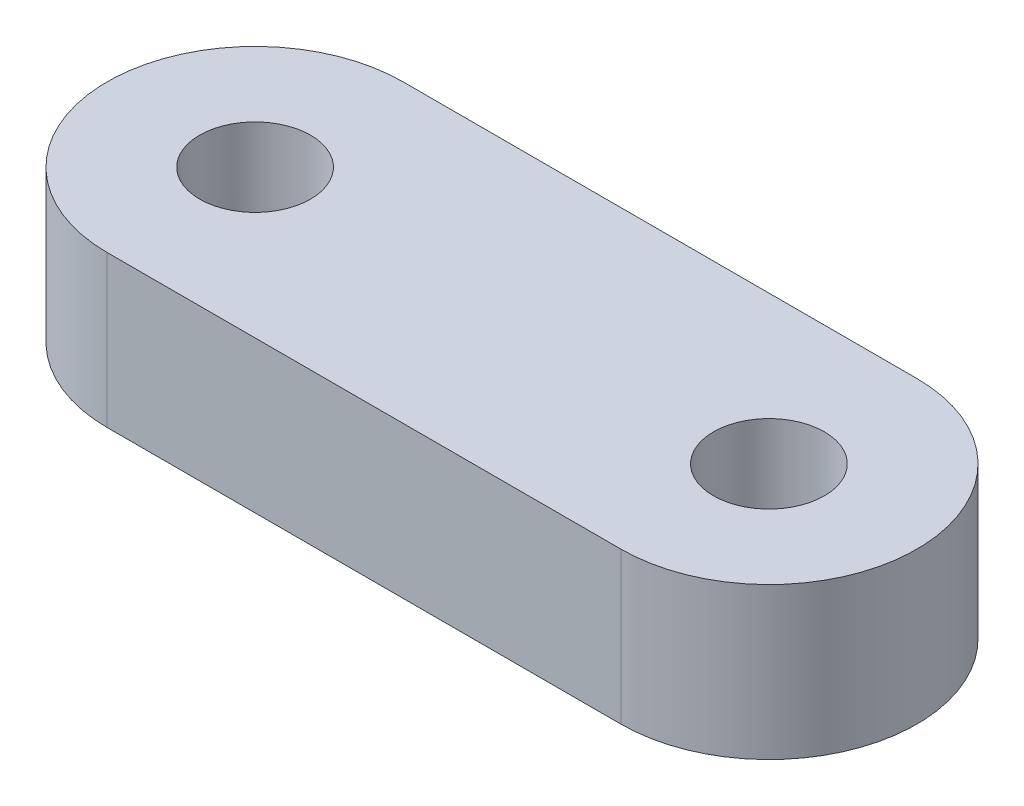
ISO-10303-21;
HEADER;
FILE_DESCRIPTION(('STEP AP214'),'2;1');
FILE_NAME('part.step','',(''),(''),'','','');
FILE_SCHEMA(('AUTOMOTIVE_DESIGN { 1 0 10303 214 1 1 1 1 }'));
ENDSEC;
DATA;
#1=APPLICATION_CONTEXT('core data for automotive mechanical design processes');
#2=APPLICATION_PROTOCOL_DEFINITION('international standard','automotive_design',2000,#1);
#3=PRODUCT_CONTEXT('',#1,'mechanical');
#4=PRODUCT('Part','Part','',(#3));
#5=PRODUCT_RELATED_PRODUCT_CATEGORY('part','',(#4));
#6=PRODUCT_DEFINITION_FORMATION('','',#4);
#7=PRODUCT_DEFINITION_CONTEXT('part definition',#1,'design');
#8=PRODUCT_DEFINITION('design','',#6,#7);
#9=PRODUCT_DEFINITION_SHAPE('','',#8);
#10=(LENGTH_UNIT() NAMED_UNIT(*) SI_UNIT(.MILLI.,.METRE.));
#11=(NAMED_UNIT(*) PLANE_ANGLE_UNIT() SI_UNIT($,.RADIAN.));
#12=(NAMED_UNIT(*) SI_UNIT($,.STERADIAN.) SOLID_ANGLE_UNIT());
#13=UNCERTAINTY_MEASURE_WITH_UNIT(LENGTH_MEASURE(1.E-05),#10,'distance_accuracy_value','');
#14=(GEOMETRIC_REPRESENTATION_CONTEXT(3) GLOBAL_UNCERTAINTY_ASSIGNED_CONTEXT((#13)) GLOBAL_UNIT_ASSIGNED_CONTEXT((#10,
#11,#12)) REPRESENTATION_CONTEXT('',''));
#15=CARTESIAN_POINT('',(0.,0.,0.));
#16=DIRECTION('',(0.,0.,1.));
#17=DIRECTION('',(1.,0.,0.));
#18=AXIS2_PLACEMENT_3D('',#15,#16,#17);
#19=CARTESIAN_POINT('',(13.9,0.05,-4.));
#20=DIRECTION('',(0.,0.,1.));
#21=DIRECTION('',(0.,-1.,0.));
#22=AXIS2_PLACEMENT_3D('',#19,#20,#21);
#23=PLANE('',#22);
#24=DIRECTION('',(0.,-1.,0.));
#25=VECTOR('',#24,1.);
#26=CARTESIAN_POINT('',(13.9,0.05,-4.));
#27=LINE('',#26,#25);
#28=CARTESIAN_POINT('',(13.9,2.05,-4.));
#29=VERTEX_POINT('',#28);
#30=CARTESIAN_POINT('',(13.9,-2.05,-4.));
#31=VERTEX_POINT('',#30);
#32=EDGE_CURVE('E31',#29,#31,#27,.T.);
#33=ORIENTED_EDGE('',*,*,#32,.T.);
#34=DIRECTION('',(1.,0.,0.));
#35=VECTOR('',#34,1.);
#36=CARTESIAN_POINT('',(0.,-2.05,-4.));
#37=LINE('',#36,#35);
#38=CARTESIAN_POINT('',(0.,-2.05,-4.));
#39=VERTEX_POINT('',#38);
#40=EDGE_CURVE('E68',#39,#31,#37,.T.);
#41=ORIENTED_EDGE('',*,*,#40,.F.);
#42=DIRECTION('',(0.,-1.,0.));
#43=VECTOR('',#42,1.);
#44=CARTESIAN_POINT('',(0.,0.05,-4.));
#45=LINE('',#44,#43);
#46=CARTESIAN_POINT('',(0.,2.05,-4.));
#47=VERTEX_POINT('',#46);
#48=EDGE_CURVE('E9',#47,#39,#45,.T.);
#49=ORIENTED_EDGE('',*,*,#48,.F.);
#50=DIRECTION('',(-1.,0.,0.));
#51=VECTOR('',#50,1.);
#52=CARTESIAN_POINT('',(13.9,2.05,-4.));
#53=LINE('',#52,#51);
#54=EDGE_CURVE('E86',#29,#47,#53,.T.);
#55=ORIENTED_EDGE('',*,*,#54,.F.);
#56=EDGE_LOOP('',(#33,#41,#49,#55));
#57=FACE_BOUND('',#56,.T.);
#58=ADVANCED_FACE('F14',(#57),#23,.F.);
#59=CARTESIAN_POINT('',(0.,0.05,0.));
#60=DIRECTION('',(0.,-1.,0.));
#61=DIRECTION('',(-1.,0.,0.));
#62=AXIS2_PLACEMENT_3D('',#59,#60,#61);
#63=CYLINDRICAL_SURFACE('',#62,4.);
#64=ORIENTED_EDGE('',*,*,#48,.T.);
#65=CARTESIAN_POINT('',(0.,-2.05,0.));
#66=DIRECTION('',(0.,-1.,0.));
#67=DIRECTION('',(-1.,0.,0.));
#68=AXIS2_PLACEMENT_3D('',#65,#66,#67);
#69=CIRCLE('',#68,4.);
#70=CARTESIAN_POINT('',(0.,-2.05,4.));
#71=VERTEX_POINT('',#70);
#72=EDGE_CURVE('E61',#71,#39,#69,.T.);
#73=ORIENTED_EDGE('',*,*,#72,.F.);
#74=DIRECTION('',(0.,-1.,0.));
#75=VECTOR('',#74,1.);
#76=CARTESIAN_POINT('',(0.,0.05,4.));
#77=LINE('',#76,#75);
#78=CARTESIAN_POINT('',(0.,2.05,4.));
#79=VERTEX_POINT('',#78);
#80=EDGE_CURVE('E23',#79,#71,#77,.T.);
#81=ORIENTED_EDGE('',*,*,#80,.F.);
#82=CARTESIAN_POINT('',(0.,2.05,0.));
#83=DIRECTION('',(0.,1.,0.));
#84=DIRECTION('',(1.,0.,0.));
#85=AXIS2_PLACEMENT_3D('',#82,#83,#84);
#86=CIRCLE('',#85,4.);
#87=EDGE_CURVE('E63',#47,#79,#86,.T.);
#88=ORIENTED_EDGE('',*,*,#87,.F.);
#89=EDGE_LOOP('',(#64,#73,#81,#88));
#90=FACE_BOUND('',#89,.T.);
#91=ADVANCED_FACE('F59',(#90),#63,.T.);
#92=CARTESIAN_POINT('',(0.,0.05,4.));
#93=DIRECTION('',(0.,0.,-1.));
#94=DIRECTION('',(0.,1.,0.));
#95=AXIS2_PLACEMENT_3D('',#92,#93,#94);
#96=PLANE('',#95);
#97=ORIENTED_EDGE('',*,*,#80,.T.);
#98=DIRECTION('',(-1.,0.,0.));
#99=VECTOR('',#98,1.);
#100=CARTESIAN_POINT('',(13.9,-2.05,4.));
#101=LINE('',#100,#99);
#102=CARTESIAN_POINT('',(13.9,-2.05,4.));
#103=VERTEX_POINT('',#102);
#104=EDGE_CURVE('E76',#103,#71,#101,.T.);
#105=ORIENTED_EDGE('',*,*,#104,.F.);
#106=DIRECTION('',(0.,-1.,0.));
#107=VECTOR('',#106,1.);
#108=CARTESIAN_POINT('',(13.9,0.05,4.));
#109=LINE('',#108,#107);
#110=CARTESIAN_POINT('',(13.9,2.05,4.));
#111=VERTEX_POINT('',#110);
#112=EDGE_CURVE('E39',#111,#103,#109,.T.);
#113=ORIENTED_EDGE('',*,*,#112,.F.);
#114=DIRECTION('',(1.,0.,0.));
#115=VECTOR('',#114,1.);
#116=CARTESIAN_POINT('',(0.,2.05,4.));
#117=LINE('',#116,#115);
#118=EDGE_CURVE('E91',#79,#111,#117,.T.);
#119=ORIENTED_EDGE('',*,*,#118,.F.);
#120=EDGE_LOOP('',(#97,#105,#113,#119));
#121=FACE_BOUND('',#120,.T.);
#122=ADVANCED_FACE('F109',(#121),#96,.F.);
#123=CARTESIAN_POINT('',(13.9,0.05,0.));
#124=DIRECTION('',(0.,-1.,0.));
#125=DIRECTION('',(-1.,0.,0.));
#126=AXIS2_PLACEMENT_3D('',#123,#124,#125);
#127=CYLINDRICAL_SURFACE('',#126,1.5);
#128=CARTESIAN_POINT('',(13.9,2.05,0.));
#129=DIRECTION('',(0.,1.,0.));
#130=DIRECTION('',(1.,0.,0.));
#131=AXIS2_PLACEMENT_3D('',#128,#129,#130);
#132=CIRCLE('',#131,1.5);
#133=CARTESIAN_POINT('',(15.4,2.05,0.));
#134=VERTEX_POINT('',#133);
#135=EDGE_CURVE('E95',#134,#134,#132,.T.);
#136=ORIENTED_EDGE('',*,*,#135,.T.);
#137=EDGE_LOOP('',(#136));
#138=FACE_BOUND('',#137,.T.);
#139=CARTESIAN_POINT('',(13.9,-2.05,0.));
#140=DIRECTION('',(0.,-1.,0.));
#141=DIRECTION('',(-1.,0.,0.));
#142=AXIS2_PLACEMENT_3D('',#139,#140,#141);
#143=CIRCLE('',#142,1.5);
#144=CARTESIAN_POINT('',(12.4,-2.05,0.));
#145=VERTEX_POINT('',#144);
#146=EDGE_CURVE('E77',#145,#145,#143,.T.);
#147=ORIENTED_EDGE('',*,*,#146,.T.);
#148=EDGE_LOOP('',(#147));
#149=FACE_BOUND('',#148,.T.);
#150=ADVANCED_FACE('F111',(#138,#149),#127,.F.);
#151=CARTESIAN_POINT('',(0.,0.05,0.));
#152=DIRECTION('',(0.,-1.,0.));
#153=DIRECTION('',(-1.,0.,0.));
#154=AXIS2_PLACEMENT_3D('',#151,#152,#153);
#155=CYLINDRICAL_SURFACE('',#154,1.5);
#156=CARTESIAN_POINT('',(0.,2.05,0.));
#157=DIRECTION('',(0.,1.,0.));
#158=DIRECTION('',(1.,0.,0.));
#159=AXIS2_PLACEMENT_3D('',#156,#157,#158);
#160=CIRCLE('',#159,1.5);
#161=CARTESIAN_POINT('',(1.5,2.05,0.));
#162=VERTEX_POINT('',#161);
#163=EDGE_CURVE('E18',#162,#162,#160,.T.);
#164=ORIENTED_EDGE('',*,*,#163,.T.);
#165=EDGE_LOOP('',(#164));
#166=FACE_BOUND('',#165,.T.);
#167=CARTESIAN_POINT('',(0.,-2.05,0.));
#168=DIRECTION('',(0.,-1.,0.));
#169=DIRECTION('',(-1.,0.,0.));
#170=AXIS2_PLACEMENT_3D('',#167,#168,#169);
#171=CIRCLE('',#170,1.5);
#172=CARTESIAN_POINT('',(-1.5,-2.05,0.));
#173=VERTEX_POINT('',#172);
#174=EDGE_CURVE('E80',#173,#173,#171,.T.);
#175=ORIENTED_EDGE('',*,*,#174,.T.);
#176=EDGE_LOOP('',(#175));
#177=FACE_BOUND('',#176,.T.);
#178=ADVANCED_FACE('F102',(#166,#177),#155,.F.);
#179=CARTESIAN_POINT('',(13.9,0.05,0.));
#180=DIRECTION('',(0.,-1.,0.));
#181=DIRECTION('',(-1.,0.,0.));
#182=AXIS2_PLACEMENT_3D('',#179,#180,#181);
#183=CYLINDRICAL_SURFACE('',#182,4.);
#184=ORIENTED_EDGE('',*,*,#112,.T.);
#185=CARTESIAN_POINT('',(13.9,-2.05,0.));
#186=DIRECTION('',(0.,-1.,0.));
#187=DIRECTION('',(-1.,0.,0.));
#188=AXIS2_PLACEMENT_3D('',#185,#186,#187);
#189=CIRCLE('',#188,4.);
#190=EDGE_CURVE('E71',#31,#103,#189,.T.);
#191=ORIENTED_EDGE('',*,*,#190,.F.);
#192=ORIENTED_EDGE('',*,*,#32,.F.);
#193=CARTESIAN_POINT('',(13.9,2.05,0.));
#194=DIRECTION('',(0.,1.,0.));
#195=DIRECTION('',(-1.,0.,0.));
#196=AXIS2_PLACEMENT_3D('',#193,#194,#195);
#197=CIRCLE('',#196,4.);
#198=EDGE_CURVE('E93',#111,#29,#197,.T.);
#199=ORIENTED_EDGE('',*,*,#198,.F.);
#200=EDGE_LOOP('',(#184,#191,#192,#199));
#201=FACE_BOUND('',#200,.T.);
#202=ADVANCED_FACE('F107',(#201),#183,.T.);
#203=CARTESIAN_POINT('',(0.,2.05,0.));
#204=DIRECTION('',(0.,1.,0.));
#205=DIRECTION('',(1.,0.,0.));
#206=AXIS2_PLACEMENT_3D('',#203,#204,#205);
#207=PLANE('',#206);
#208=ORIENTED_EDGE('',*,*,#163,.F.);
#209=EDGE_LOOP('',(#208));
#210=FACE_BOUND('',#209,.T.);
#211=ORIENTED_EDGE('',*,*,#135,.F.);
#212=EDGE_LOOP('',(#211));
#213=FACE_BOUND('',#212,.T.);
#214=ORIENTED_EDGE('',*,*,#54,.T.);
#215=ORIENTED_EDGE('',*,*,#87,.T.);
#216=ORIENTED_EDGE('',*,*,#118,.T.);
#217=ORIENTED_EDGE('',*,*,#198,.T.);
#218=EDGE_LOOP('',(#214,#215,#216,#217));
#219=FACE_BOUND('',#218,.T.);
#220=ADVANCED_FACE('F16',(#210,#213,#219),#207,.T.);
#221=CARTESIAN_POINT('',(0.,-2.05,0.));
#222=DIRECTION('',(0.,-1.,0.));
#223=DIRECTION('',(-1.,0.,0.));
#224=AXIS2_PLACEMENT_3D('',#221,#222,#223);
#225=PLANE('',#224);
#226=ORIENTED_EDGE('',*,*,#146,.F.);
#227=EDGE_LOOP('',(#226));
#228=FACE_BOUND('',#227,.T.);
#229=ORIENTED_EDGE('',*,*,#72,.T.);
#230=ORIENTED_EDGE('',*,*,#40,.T.);
#231=ORIENTED_EDGE('',*,*,#190,.T.);
#232=ORIENTED_EDGE('',*,*,#104,.T.);
#233=EDGE_LOOP('',(#229,#230,#231,#232));
#234=FACE_BOUND('',#233,.T.);
#235=ORIENTED_EDGE('',*,*,#174,.F.);
#236=EDGE_LOOP('',(#235));
#237=FACE_BOUND('',#236,.T.);
#238=ADVANCED_FACE('F74',(#228,#234,#237),#225,.T.);
#239=CLOSED_SHELL('',(#58,#91,#122,#150,#178,#202,#220,#238));
#240=MANIFOLD_SOLID_BREP('B1',#239);
#241=ADVANCED_BREP_SHAPE_REPRESENTATION('',(#18,#240),#14);
#242=SHAPE_DEFINITION_REPRESENTATION(#9,#241);
ENDSEC;
END-ISO-10303-21;
